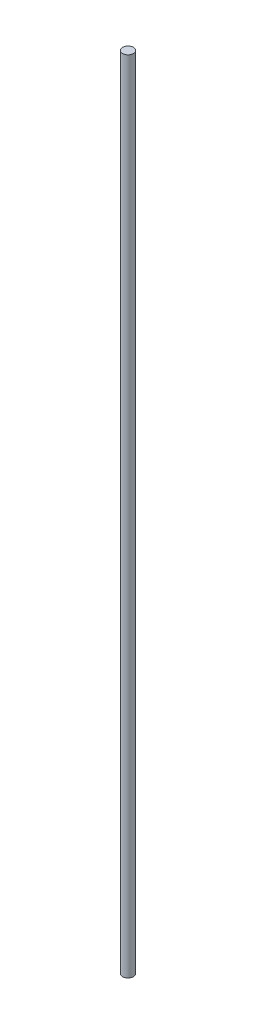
from build123d import *

# Parameters (mm, degrees)
ESQUISSE1_W = 1.25
ESQUISSE1_H = 185


with BuildPart() as part:
    # Esquisse1 → R_volution1 (revolve)
    with BuildSketch(Plane.XY, mode=Mode.PRIVATE) as r_volution1_sk:
        with Locations((0.625, 0)):
            Rectangle(ESQUISSE1_W, ESQUISSE1_H)
    revolve(r_volution1_sk.sketch.rotate(Axis((0, 66.422320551, 0), (0, -1, 0)), 90), axis=Axis((0, 66.422320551, 0), (0, -1, 0)))


solid = part.part
